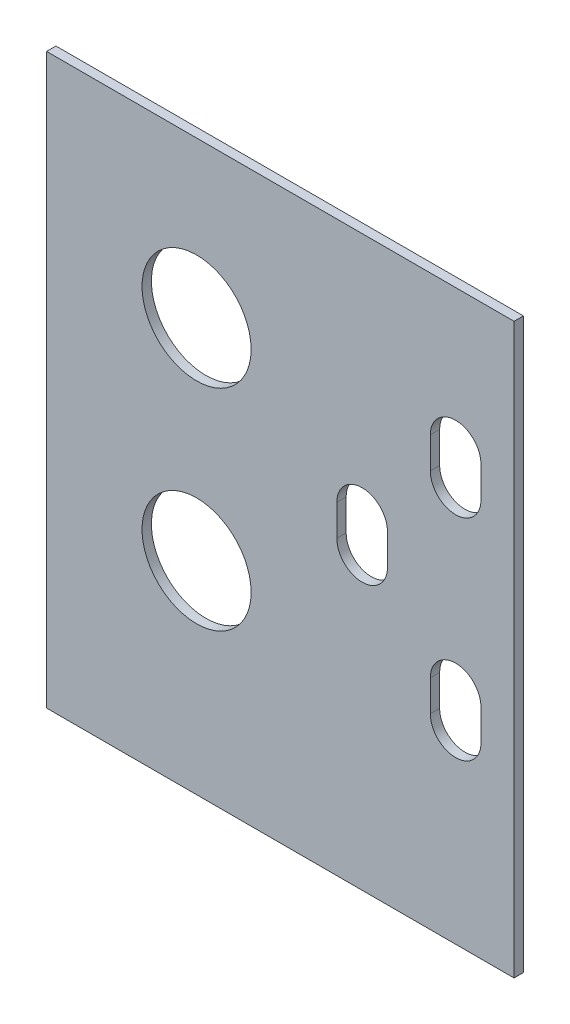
ISO-10303-21;
HEADER;
FILE_DESCRIPTION(('STEP AP214'),'2;1');
FILE_NAME('part.step','',(''),(''),'','','');
FILE_SCHEMA(('AUTOMOTIVE_DESIGN { 1 0 10303 214 1 1 1 1 }'));
ENDSEC;
DATA;
#1=APPLICATION_CONTEXT('core data for automotive mechanical design processes');
#2=APPLICATION_PROTOCOL_DEFINITION('international standard','automotive_design',2000,#1);
#3=PRODUCT_CONTEXT('',#1,'mechanical');
#4=PRODUCT('Part','Part','',(#3));
#5=PRODUCT_RELATED_PRODUCT_CATEGORY('part','',(#4));
#6=PRODUCT_DEFINITION_FORMATION('','',#4);
#7=PRODUCT_DEFINITION_CONTEXT('part definition',#1,'design');
#8=PRODUCT_DEFINITION('design','',#6,#7);
#9=PRODUCT_DEFINITION_SHAPE('','',#8);
#10=(LENGTH_UNIT() NAMED_UNIT(*) SI_UNIT(.MILLI.,.METRE.));
#11=(NAMED_UNIT(*) PLANE_ANGLE_UNIT() SI_UNIT($,.RADIAN.));
#12=(NAMED_UNIT(*) SI_UNIT($,.STERADIAN.) SOLID_ANGLE_UNIT());
#13=UNCERTAINTY_MEASURE_WITH_UNIT(LENGTH_MEASURE(1.E-05),#10,'distance_accuracy_value','');
#14=(GEOMETRIC_REPRESENTATION_CONTEXT(3) GLOBAL_UNCERTAINTY_ASSIGNED_CONTEXT((#13)) GLOBAL_UNIT_ASSIGNED_CONTEXT((#10,
#11,#12)) REPRESENTATION_CONTEXT('',''));
#15=CARTESIAN_POINT('',(0.,0.,0.));
#16=DIRECTION('',(0.,0.,1.));
#17=DIRECTION('',(1.,0.,0.));
#18=AXIS2_PLACEMENT_3D('',#15,#16,#17);
#19=CARTESIAN_POINT('',(0.,0.,-1.2));
#20=DIRECTION('',(-1.,0.,0.));
#21=DIRECTION('',(0.,0.,1.));
#22=AXIS2_PLACEMENT_3D('',#19,#20,#21);
#23=PLANE('',#22);
#24=DIRECTION('',(0.,-1.,0.));
#25=VECTOR('',#24,1.);
#26=CARTESIAN_POINT('',(0.,0.,0.));
#27=LINE('',#26,#25);
#28=CARTESIAN_POINT('',(0.,73.,0.));
#29=VERTEX_POINT('',#28);
#30=CARTESIAN_POINT('',(0.,0.,0.));
#31=VERTEX_POINT('',#30);
#32=EDGE_CURVE('E194',#29,#31,#27,.T.);
#33=ORIENTED_EDGE('',*,*,#32,.F.);
#34=DIRECTION('',(0.,0.,1.));
#35=VECTOR('',#34,1.);
#36=CARTESIAN_POINT('',(0.,73.,-1.2));
#37=LINE('',#36,#35);
#38=CARTESIAN_POINT('',(0.,73.,-1.2));
#39=VERTEX_POINT('',#38);
#40=EDGE_CURVE('E11',#39,#29,#37,.T.);
#41=ORIENTED_EDGE('',*,*,#40,.F.);
#42=DIRECTION('',(0.,-1.,0.));
#43=VECTOR('',#42,1.);
#44=CARTESIAN_POINT('',(0.,0.,-1.2));
#45=LINE('',#44,#43);
#46=CARTESIAN_POINT('',(0.,0.,-1.2));
#47=VERTEX_POINT('',#46);
#48=EDGE_CURVE('E260',#39,#47,#45,.T.);
#49=ORIENTED_EDGE('',*,*,#48,.T.);
#50=DIRECTION('',(0.,0.,1.));
#51=VECTOR('',#50,1.);
#52=CARTESIAN_POINT('',(0.,0.,-1.2));
#53=LINE('',#52,#51);
#54=EDGE_CURVE('E43',#47,#31,#53,.T.);
#55=ORIENTED_EDGE('',*,*,#54,.T.);
#56=EDGE_LOOP('',(#33,#41,#49,#55));
#57=FACE_BOUND('',#56,.T.);
#58=ADVANCED_FACE('F40',(#57),#23,.T.);
#59=CARTESIAN_POINT('',(0.,73.,-1.2));
#60=DIRECTION('',(0.,1.,0.));
#61=DIRECTION('',(0.,0.,1.));
#62=AXIS2_PLACEMENT_3D('',#59,#60,#61);
#63=PLANE('',#62);
#64=DIRECTION('',(-1.,0.,0.));
#65=VECTOR('',#64,1.);
#66=CARTESIAN_POINT('',(0.,73.,0.));
#67=LINE('',#66,#65);
#68=CARTESIAN_POINT('',(60.,73.,0.));
#69=VERTEX_POINT('',#68);
#70=EDGE_CURVE('E264',#69,#29,#67,.T.);
#71=ORIENTED_EDGE('',*,*,#70,.F.);
#72=DIRECTION('',(0.,0.,1.));
#73=VECTOR('',#72,1.);
#74=CARTESIAN_POINT('',(60.,73.,-1.2));
#75=LINE('',#74,#73);
#76=CARTESIAN_POINT('',(60.,73.,-1.2));
#77=VERTEX_POINT('',#76);
#78=EDGE_CURVE('E48',#77,#69,#75,.T.);
#79=ORIENTED_EDGE('',*,*,#78,.F.);
#80=DIRECTION('',(-1.,0.,0.));
#81=VECTOR('',#80,1.);
#82=CARTESIAN_POINT('',(0.,73.,-1.2));
#83=LINE('',#82,#81);
#84=EDGE_CURVE('E270',#77,#39,#83,.T.);
#85=ORIENTED_EDGE('',*,*,#84,.T.);
#86=ORIENTED_EDGE('',*,*,#40,.T.);
#87=EDGE_LOOP('',(#71,#79,#85,#86));
#88=FACE_BOUND('',#87,.T.);
#89=ADVANCED_FACE('F296',(#88),#63,.T.);
#90=CARTESIAN_POINT('',(60.,0.,-1.2));
#91=DIRECTION('',(1.,0.,0.));
#92=DIRECTION('',(0.,0.,-1.));
#93=AXIS2_PLACEMENT_3D('',#90,#91,#92);
#94=PLANE('',#93);
#95=DIRECTION('',(0.,1.,0.));
#96=VECTOR('',#95,1.);
#97=CARTESIAN_POINT('',(60.,0.,0.));
#98=LINE('',#97,#96);
#99=CARTESIAN_POINT('',(60.,0.,0.));
#100=VERTEX_POINT('',#99);
#101=EDGE_CURVE('E278',#100,#69,#98,.T.);
#102=ORIENTED_EDGE('',*,*,#101,.F.);
#103=DIRECTION('',(0.,0.,1.));
#104=VECTOR('',#103,1.);
#105=CARTESIAN_POINT('',(60.,0.,-1.2));
#106=LINE('',#105,#104);
#107=CARTESIAN_POINT('',(60.,0.,-1.2));
#108=VERTEX_POINT('',#107);
#109=EDGE_CURVE('E283',#108,#100,#106,.T.);
#110=ORIENTED_EDGE('',*,*,#109,.F.);
#111=DIRECTION('',(0.,1.,0.));
#112=VECTOR('',#111,1.);
#113=CARTESIAN_POINT('',(60.,0.,-1.2));
#114=LINE('',#113,#112);
#115=EDGE_CURVE('E267',#108,#77,#114,.T.);
#116=ORIENTED_EDGE('',*,*,#115,.T.);
#117=ORIENTED_EDGE('',*,*,#78,.T.);
#118=EDGE_LOOP('',(#102,#110,#116,#117));
#119=FACE_BOUND('',#118,.T.);
#120=ADVANCED_FACE('F301',(#119),#94,.T.);
#121=CARTESIAN_POINT('',(0.,0.,-1.2));
#122=DIRECTION('',(0.,-1.,0.));
#123=DIRECTION('',(0.,0.,-1.));
#124=AXIS2_PLACEMENT_3D('',#121,#122,#123);
#125=PLANE('',#124);
#126=DIRECTION('',(1.,0.,0.));
#127=VECTOR('',#126,1.);
#128=CARTESIAN_POINT('',(0.,0.,0.));
#129=LINE('',#128,#127);
#130=EDGE_CURVE('E275',#31,#100,#129,.T.);
#131=ORIENTED_EDGE('',*,*,#130,.F.);
#132=ORIENTED_EDGE('',*,*,#54,.F.);
#133=DIRECTION('',(1.,0.,0.));
#134=VECTOR('',#133,1.);
#135=CARTESIAN_POINT('',(0.,0.,-1.2));
#136=LINE('',#135,#134);
#137=EDGE_CURVE('E263',#47,#108,#136,.T.);
#138=ORIENTED_EDGE('',*,*,#137,.T.);
#139=ORIENTED_EDGE('',*,*,#109,.T.);
#140=EDGE_LOOP('',(#131,#132,#138,#139));
#141=FACE_BOUND('',#140,.T.);
#142=ADVANCED_FACE('F291',(#141),#125,.T.);
#143=CARTESIAN_POINT('',(0.,0.,-1.2));
#144=DIRECTION('',(0.,0.,-1.));
#145=DIRECTION('',(-1.,0.,0.));
#146=AXIS2_PLACEMENT_3D('',#143,#144,#145);
#147=PLANE('',#146);
#148=CARTESIAN_POINT('',(19.2499999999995,53.,-1.2));
#149=DIRECTION('',(0.,0.,1.));
#150=DIRECTION('',(1.,0.,0.));
#151=AXIS2_PLACEMENT_3D('',#148,#149,#150);
#152=CIRCLE('',#151,7.);
#153=CARTESIAN_POINT('',(26.2499999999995,53.,-1.2));
#154=VERTEX_POINT('',#153);
#155=EDGE_CURVE('E245',#154,#154,#152,.T.);
#156=ORIENTED_EDGE('',*,*,#155,.T.);
#157=EDGE_LOOP('',(#156));
#158=FACE_BOUND('',#157,.T.);
#159=CARTESIAN_POINT('',(19.2499999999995,26.,-1.2));
#160=DIRECTION('',(0.,0.,1.));
#161=DIRECTION('',(1.,0.,0.));
#162=AXIS2_PLACEMENT_3D('',#159,#160,#161);
#163=CIRCLE('',#162,7.);
#164=CARTESIAN_POINT('',(26.2499999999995,26.,-1.2));
#165=VERTEX_POINT('',#164);
#166=EDGE_CURVE('E558',#165,#165,#163,.T.);
#167=ORIENTED_EDGE('',*,*,#166,.T.);
#168=EDGE_LOOP('',(#167));
#169=FACE_BOUND('',#168,.T.);
#170=CARTESIAN_POINT('',(40.5,37.5,-1.2));
#171=DIRECTION('',(0.,0.,1.));
#172=DIRECTION('',(1.,0.,0.));
#173=AXIS2_PLACEMENT_3D('',#170,#171,#172);
#174=CIRCLE('',#173,3.25000000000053);
#175=CARTESIAN_POINT('',(37.2499999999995,37.5,-1.2));
#176=VERTEX_POINT('',#175);
#177=CARTESIAN_POINT('',(43.7500000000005,37.5,-1.2));
#178=VERTEX_POINT('',#177);
#179=EDGE_CURVE('E157',#176,#178,#174,.T.);
#180=ORIENTED_EDGE('',*,*,#179,.T.);
#181=DIRECTION('',(0.,1.,0.));
#182=VECTOR('',#181,1.);
#183=CARTESIAN_POINT('',(43.7500000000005,37.5,-1.2));
#184=LINE('',#183,#182);
#185=CARTESIAN_POINT('',(43.7500000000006,41.5,-1.2));
#186=VERTEX_POINT('',#185);
#187=EDGE_CURVE('E168',#178,#186,#184,.T.);
#188=ORIENTED_EDGE('',*,*,#187,.T.);
#189=CARTESIAN_POINT('',(40.5000000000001,41.5,-1.2));
#190=DIRECTION('',(0.,0.,1.));
#191=DIRECTION('',(1.,0.,0.));
#192=AXIS2_PLACEMENT_3D('',#189,#190,#191);
#193=CIRCLE('',#192,3.25000000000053);
#194=CARTESIAN_POINT('',(37.2499999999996,41.5,-1.2));
#195=VERTEX_POINT('',#194);
#196=EDGE_CURVE('E56',#186,#195,#193,.T.);
#197=ORIENTED_EDGE('',*,*,#196,.T.);
#198=DIRECTION('',(0.,-1.,0.));
#199=VECTOR('',#198,1.);
#200=CARTESIAN_POINT('',(37.2499999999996,41.5,-1.2));
#201=LINE('',#200,#199);
#202=EDGE_CURVE('E165',#195,#176,#201,.T.);
#203=ORIENTED_EDGE('',*,*,#202,.T.);
#204=EDGE_LOOP('',(#180,#188,#197,#203));
#205=FACE_BOUND('',#204,.T.);
#206=CARTESIAN_POINT('',(52.5,24.,-1.2));
#207=DIRECTION('',(0.,0.,1.));
#208=DIRECTION('',(1.,0.,0.));
#209=AXIS2_PLACEMENT_3D('',#206,#207,#208);
#210=CIRCLE('',#209,3.25000000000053);
#211=CARTESIAN_POINT('',(49.2499999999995,24.,-1.2));
#212=VERTEX_POINT('',#211);
#213=CARTESIAN_POINT('',(55.7500000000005,24.,-1.2));
#214=VERTEX_POINT('',#213);
#215=EDGE_CURVE('E198',#212,#214,#210,.T.);
#216=ORIENTED_EDGE('',*,*,#215,.T.);
#217=DIRECTION('',(0.,1.,0.));
#218=VECTOR('',#217,1.);
#219=CARTESIAN_POINT('',(55.7500000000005,24.,-1.2));
#220=LINE('',#219,#218);
#221=CARTESIAN_POINT('',(55.7500000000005,28.,-1.2));
#222=VERTEX_POINT('',#221);
#223=EDGE_CURVE('E201',#214,#222,#220,.T.);
#224=ORIENTED_EDGE('',*,*,#223,.T.);
#225=CARTESIAN_POINT('',(52.5,28.,-1.2));
#226=DIRECTION('',(0.,0.,1.));
#227=DIRECTION('',(1.,0.,0.));
#228=AXIS2_PLACEMENT_3D('',#225,#226,#227);
#229=CIRCLE('',#228,3.25000000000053);
#230=CARTESIAN_POINT('',(49.2499999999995,28.,-1.2));
#231=VERTEX_POINT('',#230);
#232=EDGE_CURVE('E64',#222,#231,#229,.T.);
#233=ORIENTED_EDGE('',*,*,#232,.T.);
#234=DIRECTION('',(0.,-1.,0.));
#235=VECTOR('',#234,1.);
#236=CARTESIAN_POINT('',(49.2499999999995,28.,-1.2));
#237=LINE('',#236,#235);
#238=EDGE_CURVE('E206',#231,#212,#237,.T.);
#239=ORIENTED_EDGE('',*,*,#238,.T.);
#240=EDGE_LOOP('',(#216,#224,#233,#239));
#241=FACE_BOUND('',#240,.T.);
#242=CARTESIAN_POINT('',(52.5,55.,-1.2));
#243=DIRECTION('',(0.,0.,1.));
#244=DIRECTION('',(1.,0.,0.));
#245=AXIS2_PLACEMENT_3D('',#242,#243,#244);
#246=CIRCLE('',#245,3.25000000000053);
#247=CARTESIAN_POINT('',(55.7500000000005,55.,-1.2));
#248=VERTEX_POINT('',#247);
#249=CARTESIAN_POINT('',(49.2499999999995,55.,-1.2));
#250=VERTEX_POINT('',#249);
#251=EDGE_CURVE('E228',#248,#250,#246,.T.);
#252=ORIENTED_EDGE('',*,*,#251,.T.);
#253=DIRECTION('',(0.,-1.,0.));
#254=VECTOR('',#253,1.);
#255=CARTESIAN_POINT('',(49.2499999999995,55.,-1.2));
#256=LINE('',#255,#254);
#257=CARTESIAN_POINT('',(49.2499999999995,51.,-1.2));
#258=VERTEX_POINT('',#257);
#259=EDGE_CURVE('E231',#250,#258,#256,.T.);
#260=ORIENTED_EDGE('',*,*,#259,.T.);
#261=CARTESIAN_POINT('',(52.5,51.,-1.2));
#262=DIRECTION('',(0.,0.,1.));
#263=DIRECTION('',(1.,0.,0.));
#264=AXIS2_PLACEMENT_3D('',#261,#262,#263);
#265=CIRCLE('',#264,3.25000000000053);
#266=CARTESIAN_POINT('',(55.7500000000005,51.,-1.2));
#267=VERTEX_POINT('',#266);
#268=EDGE_CURVE('E235',#258,#267,#265,.T.);
#269=ORIENTED_EDGE('',*,*,#268,.T.);
#270=DIRECTION('',(0.,1.,0.));
#271=VECTOR('',#270,1.);
#272=CARTESIAN_POINT('',(55.7500000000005,51.,-1.2));
#273=LINE('',#272,#271);
#274=EDGE_CURVE('E238',#267,#248,#273,.T.);
#275=ORIENTED_EDGE('',*,*,#274,.T.);
#276=EDGE_LOOP('',(#252,#260,#269,#275));
#277=FACE_BOUND('',#276,.T.);
#278=ORIENTED_EDGE('',*,*,#48,.F.);
#279=ORIENTED_EDGE('',*,*,#84,.F.);
#280=ORIENTED_EDGE('',*,*,#115,.F.);
#281=ORIENTED_EDGE('',*,*,#137,.F.);
#282=EDGE_LOOP('',(#278,#279,#280,#281));
#283=FACE_BOUND('',#282,.T.);
#284=ADVANCED_FACE('F172',(#158,#169,#205,#241,#277,#283),#147,.T.);
#285=CARTESIAN_POINT('',(0.,0.,0.));
#286=DIRECTION('',(0.,0.,-1.));
#287=DIRECTION('',(-1.,0.,0.));
#288=AXIS2_PLACEMENT_3D('',#285,#286,#287);
#289=PLANE('',#288);
#290=CARTESIAN_POINT('',(19.2499999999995,53.,0.));
#291=DIRECTION('',(0.,0.,1.));
#292=DIRECTION('',(1.,0.,0.));
#293=AXIS2_PLACEMENT_3D('',#290,#291,#292);
#294=CIRCLE('',#293,7.);
#295=CARTESIAN_POINT('',(26.2499999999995,53.,0.));
#296=VERTEX_POINT('',#295);
#297=EDGE_CURVE('E557',#296,#296,#294,.T.);
#298=ORIENTED_EDGE('',*,*,#297,.F.);
#299=EDGE_LOOP('',(#298));
#300=FACE_BOUND('',#299,.T.);
#301=CARTESIAN_POINT('',(19.2499999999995,26.,0.));
#302=DIRECTION('',(0.,0.,1.));
#303=DIRECTION('',(1.,0.,0.));
#304=AXIS2_PLACEMENT_3D('',#301,#302,#303);
#305=CIRCLE('',#304,7.);
#306=CARTESIAN_POINT('',(26.2499999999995,26.,0.));
#307=VERTEX_POINT('',#306);
#308=EDGE_CURVE('E181',#307,#307,#305,.T.);
#309=ORIENTED_EDGE('',*,*,#308,.F.);
#310=EDGE_LOOP('',(#309));
#311=FACE_BOUND('',#310,.T.);
#312=DIRECTION('',(0.,1.,0.));
#313=VECTOR('',#312,1.);
#314=CARTESIAN_POINT('',(43.7500000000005,37.5,0.));
#315=LINE('',#314,#313);
#316=CARTESIAN_POINT('',(43.7500000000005,37.5,0.));
#317=VERTEX_POINT('',#316);
#318=CARTESIAN_POINT('',(43.7500000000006,41.5,0.));
#319=VERTEX_POINT('',#318);
#320=EDGE_CURVE('E187',#317,#319,#315,.T.);
#321=ORIENTED_EDGE('',*,*,#320,.F.);
#322=CARTESIAN_POINT('',(40.5,37.5,0.));
#323=DIRECTION('',(0.,0.,1.));
#324=DIRECTION('',(1.,0.,0.));
#325=AXIS2_PLACEMENT_3D('',#322,#323,#324);
#326=CIRCLE('',#325,3.25000000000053);
#327=CARTESIAN_POINT('',(37.2499999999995,37.5,0.));
#328=VERTEX_POINT('',#327);
#329=EDGE_CURVE('E160',#328,#317,#326,.T.);
#330=ORIENTED_EDGE('',*,*,#329,.F.);
#331=DIRECTION('',(0.,-1.,0.));
#332=VECTOR('',#331,1.);
#333=CARTESIAN_POINT('',(37.2499999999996,41.5,0.));
#334=LINE('',#333,#332);
#335=CARTESIAN_POINT('',(37.2499999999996,41.5,0.));
#336=VERTEX_POINT('',#335);
#337=EDGE_CURVE('E175',#336,#328,#334,.T.);
#338=ORIENTED_EDGE('',*,*,#337,.F.);
#339=CARTESIAN_POINT('',(40.5000000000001,41.5,0.));
#340=DIRECTION('',(0.,0.,1.));
#341=DIRECTION('',(1.,0.,0.));
#342=AXIS2_PLACEMENT_3D('',#339,#340,#341);
#343=CIRCLE('',#342,3.25000000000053);
#344=EDGE_CURVE('E178',#319,#336,#343,.T.);
#345=ORIENTED_EDGE('',*,*,#344,.F.);
#346=EDGE_LOOP('',(#321,#330,#338,#345));
#347=FACE_BOUND('',#346,.T.);
#348=DIRECTION('',(0.,1.,0.));
#349=VECTOR('',#348,1.);
#350=CARTESIAN_POINT('',(55.7500000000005,24.,0.));
#351=LINE('',#350,#349);
#352=CARTESIAN_POINT('',(55.7500000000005,24.,0.));
#353=VERTEX_POINT('',#352);
#354=CARTESIAN_POINT('',(55.7500000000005,28.,0.));
#355=VERTEX_POINT('',#354);
#356=EDGE_CURVE('E212',#353,#355,#351,.T.);
#357=ORIENTED_EDGE('',*,*,#356,.F.);
#358=CARTESIAN_POINT('',(52.5,24.,0.));
#359=DIRECTION('',(0.,0.,1.));
#360=DIRECTION('',(1.,0.,0.));
#361=AXIS2_PLACEMENT_3D('',#358,#359,#360);
#362=CIRCLE('',#361,3.25000000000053);
#363=CARTESIAN_POINT('',(49.2499999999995,24.,0.));
#364=VERTEX_POINT('',#363);
#365=EDGE_CURVE('E210',#364,#353,#362,.T.);
#366=ORIENTED_EDGE('',*,*,#365,.F.);
#367=DIRECTION('',(0.,-1.,0.));
#368=VECTOR('',#367,1.);
#369=CARTESIAN_POINT('',(49.2499999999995,28.,0.));
#370=LINE('',#369,#368);
#371=CARTESIAN_POINT('',(49.2499999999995,28.,0.));
#372=VERTEX_POINT('',#371);
#373=EDGE_CURVE('E202',#372,#364,#370,.T.);
#374=ORIENTED_EDGE('',*,*,#373,.F.);
#375=CARTESIAN_POINT('',(52.5,28.,0.));
#376=DIRECTION('',(0.,0.,1.));
#377=DIRECTION('',(1.,0.,0.));
#378=AXIS2_PLACEMENT_3D('',#375,#376,#377);
#379=CIRCLE('',#378,3.25000000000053);
#380=EDGE_CURVE('E216',#355,#372,#379,.T.);
#381=ORIENTED_EDGE('',*,*,#380,.F.);
#382=EDGE_LOOP('',(#357,#366,#374,#381));
#383=FACE_BOUND('',#382,.T.);
#384=DIRECTION('',(0.,-1.,0.));
#385=VECTOR('',#384,1.);
#386=CARTESIAN_POINT('',(49.2499999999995,55.,0.));
#387=LINE('',#386,#385);
#388=CARTESIAN_POINT('',(49.2499999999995,55.,0.));
#389=VERTEX_POINT('',#388);
#390=CARTESIAN_POINT('',(49.2499999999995,51.,0.));
#391=VERTEX_POINT('',#390);
#392=EDGE_CURVE('E244',#389,#391,#387,.T.);
#393=ORIENTED_EDGE('',*,*,#392,.F.);
#394=CARTESIAN_POINT('',(52.5,55.,0.));
#395=DIRECTION('',(0.,0.,1.));
#396=DIRECTION('',(1.,0.,0.));
#397=AXIS2_PLACEMENT_3D('',#394,#395,#396);
#398=CIRCLE('',#397,3.25000000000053);
#399=CARTESIAN_POINT('',(55.7500000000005,55.,0.));
#400=VERTEX_POINT('',#399);
#401=EDGE_CURVE('E242',#400,#389,#398,.T.);
#402=ORIENTED_EDGE('',*,*,#401,.F.);
#403=DIRECTION('',(0.,1.,0.));
#404=VECTOR('',#403,1.);
#405=CARTESIAN_POINT('',(55.7500000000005,51.,0.));
#406=LINE('',#405,#404);
#407=CARTESIAN_POINT('',(55.7500000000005,51.,0.));
#408=VERTEX_POINT('',#407);
#409=EDGE_CURVE('E232',#408,#400,#406,.T.);
#410=ORIENTED_EDGE('',*,*,#409,.F.);
#411=CARTESIAN_POINT('',(52.5,51.,0.));
#412=DIRECTION('',(0.,0.,1.));
#413=DIRECTION('',(1.,0.,0.));
#414=AXIS2_PLACEMENT_3D('',#411,#412,#413);
#415=CIRCLE('',#414,3.25000000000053);
#416=EDGE_CURVE('E248',#391,#408,#415,.T.);
#417=ORIENTED_EDGE('',*,*,#416,.F.);
#418=EDGE_LOOP('',(#393,#402,#410,#417));
#419=FACE_BOUND('',#418,.T.);
#420=ORIENTED_EDGE('',*,*,#32,.T.);
#421=ORIENTED_EDGE('',*,*,#130,.T.);
#422=ORIENTED_EDGE('',*,*,#101,.T.);
#423=ORIENTED_EDGE('',*,*,#70,.T.);
#424=EDGE_LOOP('',(#420,#421,#422,#423));
#425=FACE_BOUND('',#424,.T.);
#426=ADVANCED_FACE('F293',(#300,#311,#347,#383,#419,#425),#289,.F.);
#427=CARTESIAN_POINT('',(52.5,55.,-1.2));
#428=DIRECTION('',(0.,0.,1.));
#429=DIRECTION('',(1.,0.,0.));
#430=AXIS2_PLACEMENT_3D('',#427,#428,#429);
#431=CYLINDRICAL_SURFACE('',#430,3.25000000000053);
#432=ORIENTED_EDGE('',*,*,#401,.T.);
#433=DIRECTION('',(0.,0.,1.));
#434=VECTOR('',#433,1.);
#435=CARTESIAN_POINT('',(49.2499999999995,55.,-1.2));
#436=LINE('',#435,#434);
#437=EDGE_CURVE('E241',#250,#389,#436,.T.);
#438=ORIENTED_EDGE('',*,*,#437,.F.);
#439=ORIENTED_EDGE('',*,*,#251,.F.);
#440=DIRECTION('',(0.,0.,1.));
#441=VECTOR('',#440,1.);
#442=CARTESIAN_POINT('',(55.7500000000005,55.,-1.2));
#443=LINE('',#442,#441);
#444=EDGE_CURVE('E213',#248,#400,#443,.T.);
#445=ORIENTED_EDGE('',*,*,#444,.T.);
#446=EDGE_LOOP('',(#432,#438,#439,#445));
#447=FACE_BOUND('',#446,.T.);
#448=ADVANCED_FACE('F336',(#447),#431,.F.);
#449=CARTESIAN_POINT('',(55.7500000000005,51.,-1.2));
#450=DIRECTION('',(1.,0.,0.));
#451=DIRECTION('',(0.,0.,-1.));
#452=AXIS2_PLACEMENT_3D('',#449,#450,#451);
#453=PLANE('',#452);
#454=ORIENTED_EDGE('',*,*,#409,.T.);
#455=ORIENTED_EDGE('',*,*,#444,.F.);
#456=ORIENTED_EDGE('',*,*,#274,.F.);
#457=DIRECTION('',(0.,0.,1.));
#458=VECTOR('',#457,1.);
#459=CARTESIAN_POINT('',(55.7500000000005,51.,-1.2));
#460=LINE('',#459,#458);
#461=EDGE_CURVE('E254',#267,#408,#460,.T.);
#462=ORIENTED_EDGE('',*,*,#461,.T.);
#463=EDGE_LOOP('',(#454,#455,#456,#462));
#464=FACE_BOUND('',#463,.T.);
#465=ADVANCED_FACE('F341',(#464),#453,.F.);
#466=CARTESIAN_POINT('',(52.5,51.,-1.2));
#467=DIRECTION('',(0.,0.,1.));
#468=DIRECTION('',(1.,0.,0.));
#469=AXIS2_PLACEMENT_3D('',#466,#467,#468);
#470=CYLINDRICAL_SURFACE('',#469,3.25000000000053);
#471=ORIENTED_EDGE('',*,*,#416,.T.);
#472=ORIENTED_EDGE('',*,*,#461,.F.);
#473=ORIENTED_EDGE('',*,*,#268,.F.);
#474=DIRECTION('',(0.,0.,1.));
#475=VECTOR('',#474,1.);
#476=CARTESIAN_POINT('',(49.2499999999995,51.,-1.2));
#477=LINE('',#476,#475);
#478=EDGE_CURVE('E256',#258,#391,#477,.T.);
#479=ORIENTED_EDGE('',*,*,#478,.T.);
#480=EDGE_LOOP('',(#471,#472,#473,#479));
#481=FACE_BOUND('',#480,.T.);
#482=ADVANCED_FACE('F354',(#481),#470,.F.);
#483=CARTESIAN_POINT('',(49.2499999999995,55.,-1.2));
#484=DIRECTION('',(-1.,0.,0.));
#485=DIRECTION('',(0.,0.,1.));
#486=AXIS2_PLACEMENT_3D('',#483,#484,#485);
#487=PLANE('',#486);
#488=ORIENTED_EDGE('',*,*,#392,.T.);
#489=ORIENTED_EDGE('',*,*,#478,.F.);
#490=ORIENTED_EDGE('',*,*,#259,.F.);
#491=ORIENTED_EDGE('',*,*,#437,.T.);
#492=EDGE_LOOP('',(#488,#489,#490,#491));
#493=FACE_BOUND('',#492,.T.);
#494=ADVANCED_FACE('F365',(#493),#487,.F.);
#495=CARTESIAN_POINT('',(52.5,24.,-1.2));
#496=DIRECTION('',(0.,0.,1.));
#497=DIRECTION('',(1.,0.,0.));
#498=AXIS2_PLACEMENT_3D('',#495,#496,#497);
#499=CYLINDRICAL_SURFACE('',#498,3.25000000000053);
#500=ORIENTED_EDGE('',*,*,#365,.T.);
#501=DIRECTION('',(0.,0.,1.));
#502=VECTOR('',#501,1.);
#503=CARTESIAN_POINT('',(55.7500000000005,24.,-1.2));
#504=LINE('',#503,#502);
#505=EDGE_CURVE('E209',#214,#353,#504,.T.);
#506=ORIENTED_EDGE('',*,*,#505,.F.);
#507=ORIENTED_EDGE('',*,*,#215,.F.);
#508=DIRECTION('',(0.,0.,1.));
#509=VECTOR('',#508,1.);
#510=CARTESIAN_POINT('',(49.2499999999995,24.,-1.2));
#511=LINE('',#510,#509);
#512=EDGE_CURVE('E188',#212,#364,#511,.T.);
#513=ORIENTED_EDGE('',*,*,#512,.T.);
#514=EDGE_LOOP('',(#500,#506,#507,#513));
#515=FACE_BOUND('',#514,.T.);
#516=ADVANCED_FACE('F376',(#515),#499,.F.);
#517=CARTESIAN_POINT('',(49.2499999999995,28.,-1.2));
#518=DIRECTION('',(-1.,0.,0.));
#519=DIRECTION('',(0.,-1.,0.));
#520=AXIS2_PLACEMENT_3D('',#517,#518,#519);
#521=PLANE('',#520);
#522=ORIENTED_EDGE('',*,*,#373,.T.);
#523=ORIENTED_EDGE('',*,*,#512,.F.);
#524=ORIENTED_EDGE('',*,*,#238,.F.);
#525=DIRECTION('',(0.,0.,1.));
#526=VECTOR('',#525,1.);
#527=CARTESIAN_POINT('',(49.2499999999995,28.,-1.2));
#528=LINE('',#527,#526);
#529=EDGE_CURVE('E222',#231,#372,#528,.T.);
#530=ORIENTED_EDGE('',*,*,#529,.T.);
#531=EDGE_LOOP('',(#522,#523,#524,#530));
#532=FACE_BOUND('',#531,.T.);
#533=ADVANCED_FACE('F387',(#532),#521,.F.);
#534=CARTESIAN_POINT('',(52.5,28.,-1.2));
#535=DIRECTION('',(0.,0.,1.));
#536=DIRECTION('',(1.,0.,0.));
#537=AXIS2_PLACEMENT_3D('',#534,#535,#536);
#538=CYLINDRICAL_SURFACE('',#537,3.25000000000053);
#539=ORIENTED_EDGE('',*,*,#380,.T.);
#540=ORIENTED_EDGE('',*,*,#529,.F.);
#541=ORIENTED_EDGE('',*,*,#232,.F.);
#542=DIRECTION('',(0.,0.,1.));
#543=VECTOR('',#542,1.);
#544=CARTESIAN_POINT('',(55.7500000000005,28.,-1.2));
#545=LINE('',#544,#543);
#546=EDGE_CURVE('E224',#222,#355,#545,.T.);
#547=ORIENTED_EDGE('',*,*,#546,.T.);
#548=EDGE_LOOP('',(#539,#540,#541,#547));
#549=FACE_BOUND('',#548,.T.);
#550=ADVANCED_FACE('F398',(#549),#538,.F.);
#551=CARTESIAN_POINT('',(55.7500000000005,24.,-1.2));
#552=DIRECTION('',(1.,0.,0.));
#553=DIRECTION('',(0.,1.,0.));
#554=AXIS2_PLACEMENT_3D('',#551,#552,#553);
#555=PLANE('',#554);
#556=ORIENTED_EDGE('',*,*,#356,.T.);
#557=ORIENTED_EDGE('',*,*,#546,.F.);
#558=ORIENTED_EDGE('',*,*,#223,.F.);
#559=ORIENTED_EDGE('',*,*,#505,.T.);
#560=EDGE_LOOP('',(#556,#557,#558,#559));
#561=FACE_BOUND('',#560,.T.);
#562=ADVANCED_FACE('F409',(#561),#555,.F.);
#563=CARTESIAN_POINT('',(40.5,37.5,-1.2));
#564=DIRECTION('',(0.,0.,1.));
#565=DIRECTION('',(1.,0.,0.));
#566=AXIS2_PLACEMENT_3D('',#563,#564,#565);
#567=CYLINDRICAL_SURFACE('',#566,3.25000000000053);
#568=ORIENTED_EDGE('',*,*,#329,.T.);
#569=DIRECTION('',(0.,0.,1.));
#570=VECTOR('',#569,1.);
#571=CARTESIAN_POINT('',(43.7500000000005,37.5,-1.2));
#572=LINE('',#571,#570);
#573=EDGE_CURVE('E153',#178,#317,#572,.T.);
#574=ORIENTED_EDGE('',*,*,#573,.F.);
#575=ORIENTED_EDGE('',*,*,#179,.F.);
#576=DIRECTION('',(0.,0.,1.));
#577=VECTOR('',#576,1.);
#578=CARTESIAN_POINT('',(37.2499999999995,37.5,-1.2));
#579=LINE('',#578,#577);
#580=EDGE_CURVE('E192',#176,#328,#579,.T.);
#581=ORIENTED_EDGE('',*,*,#580,.T.);
#582=EDGE_LOOP('',(#568,#574,#575,#581));
#583=FACE_BOUND('',#582,.T.);
#584=ADVANCED_FACE('F155',(#583),#567,.F.);
#585=CARTESIAN_POINT('',(37.2499999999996,41.5,-1.2));
#586=DIRECTION('',(-1.,0.,0.));
#587=DIRECTION('',(0.,-1.,0.));
#588=AXIS2_PLACEMENT_3D('',#585,#586,#587);
#589=PLANE('',#588);
#590=ORIENTED_EDGE('',*,*,#337,.T.);
#591=ORIENTED_EDGE('',*,*,#580,.F.);
#592=ORIENTED_EDGE('',*,*,#202,.F.);
#593=DIRECTION('',(0.,0.,1.));
#594=VECTOR('',#593,1.);
#595=CARTESIAN_POINT('',(37.2499999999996,41.5,-1.2));
#596=LINE('',#595,#594);
#597=EDGE_CURVE('E195',#195,#336,#596,.T.);
#598=ORIENTED_EDGE('',*,*,#597,.T.);
#599=EDGE_LOOP('',(#590,#591,#592,#598));
#600=FACE_BOUND('',#599,.T.);
#601=ADVANCED_FACE('F429',(#600),#589,.F.);
#602=CARTESIAN_POINT('',(40.5000000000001,41.5,-1.2));
#603=DIRECTION('',(0.,0.,1.));
#604=DIRECTION('',(1.,0.,0.));
#605=AXIS2_PLACEMENT_3D('',#602,#603,#604);
#606=CYLINDRICAL_SURFACE('',#605,3.25000000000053);
#607=ORIENTED_EDGE('',*,*,#344,.T.);
#608=ORIENTED_EDGE('',*,*,#597,.F.);
#609=ORIENTED_EDGE('',*,*,#196,.F.);
#610=DIRECTION('',(0.,0.,1.));
#611=VECTOR('',#610,1.);
#612=CARTESIAN_POINT('',(43.7500000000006,41.5,-1.2));
#613=LINE('',#612,#611);
#614=EDGE_CURVE('E164',#186,#319,#613,.T.);
#615=ORIENTED_EDGE('',*,*,#614,.T.);
#616=EDGE_LOOP('',(#607,#608,#609,#615));
#617=FACE_BOUND('',#616,.T.);
#618=ADVANCED_FACE('F439',(#617),#606,.F.);
#619=CARTESIAN_POINT('',(43.7500000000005,37.5,-1.2));
#620=DIRECTION('',(1.,0.,0.));
#621=DIRECTION('',(0.,1.,0.));
#622=AXIS2_PLACEMENT_3D('',#619,#620,#621);
#623=PLANE('',#622);
#624=ORIENTED_EDGE('',*,*,#320,.T.);
#625=ORIENTED_EDGE('',*,*,#614,.F.);
#626=ORIENTED_EDGE('',*,*,#187,.F.);
#627=ORIENTED_EDGE('',*,*,#573,.T.);
#628=EDGE_LOOP('',(#624,#625,#626,#627));
#629=FACE_BOUND('',#628,.T.);
#630=ADVANCED_FACE('F169',(#629),#623,.F.);
#631=CARTESIAN_POINT('',(19.2499999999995,26.,-1.2));
#632=DIRECTION('',(0.,0.,1.));
#633=DIRECTION('',(1.,0.,0.));
#634=AXIS2_PLACEMENT_3D('',#631,#632,#633);
#635=CYLINDRICAL_SURFACE('',#634,7.);
#636=ORIENTED_EDGE('',*,*,#166,.F.);
#637=EDGE_LOOP('',(#636));
#638=FACE_BOUND('',#637,.T.);
#639=ORIENTED_EDGE('',*,*,#308,.T.);
#640=EDGE_LOOP('',(#639));
#641=FACE_BOUND('',#640,.T.);
#642=ADVANCED_FACE('F459',(#638,#641),#635,.F.);
#643=CARTESIAN_POINT('',(19.2499999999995,53.,-1.2));
#644=DIRECTION('',(0.,0.,1.));
#645=DIRECTION('',(1.,0.,0.));
#646=AXIS2_PLACEMENT_3D('',#643,#644,#645);
#647=CYLINDRICAL_SURFACE('',#646,7.);
#648=ORIENTED_EDGE('',*,*,#155,.F.);
#649=EDGE_LOOP('',(#648));
#650=FACE_BOUND('',#649,.T.);
#651=ORIENTED_EDGE('',*,*,#297,.T.);
#652=EDGE_LOOP('',(#651));
#653=FACE_BOUND('',#652,.T.);
#654=ADVANCED_FACE('F479',(#650,#653),#647,.F.);
#655=CLOSED_SHELL('',(#58,#89,#120,#142,#284,#426,#448,#465,#482,#494,#516,#533,#550,#562,#584,
#601,#618,#630,#642,#654));
#656=MANIFOLD_SOLID_BREP('B2',#655);
#657=ADVANCED_BREP_SHAPE_REPRESENTATION('',(#18,#656),#14);
#658=SHAPE_DEFINITION_REPRESENTATION(#9,#657);
ENDSEC;
END-ISO-10303-21;
